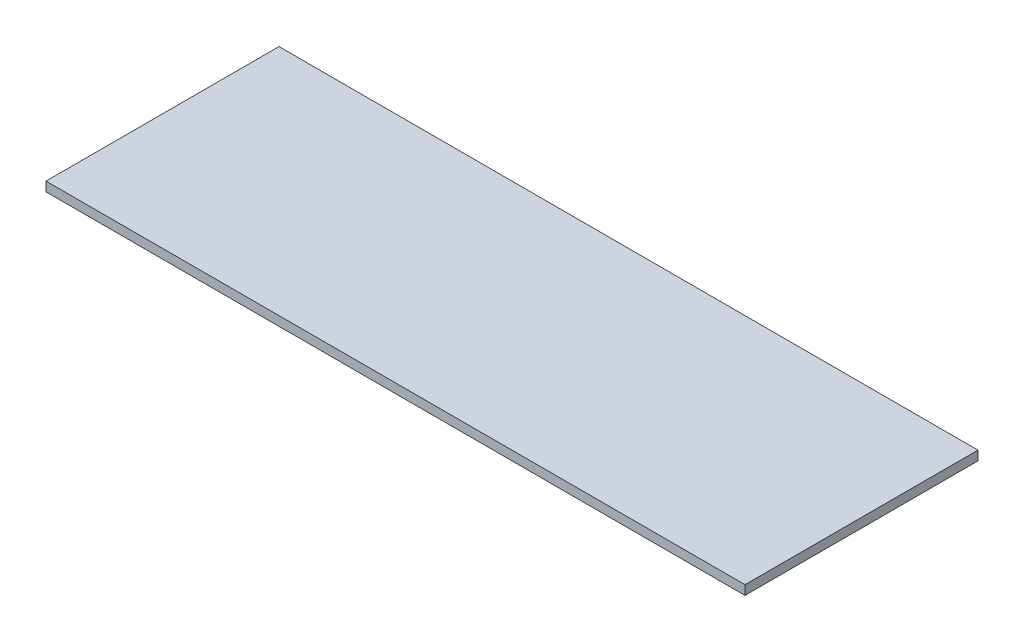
from build123d import *

# Parameters (mm, degrees)
ESQUISSE1_W      = 75
ESQUISSE1_H      = 25
EXTRUSION1_DEPTH = 1


with BuildPart() as part:
    # Esquisse1 → Extrusion1 (new body)
    with BuildSketch(Plane(origin=(0, 0, 0), x_dir=(1, 0, 0), z_dir=(0, 1, 0))):
        with Locations((37.5, 12.5)):
            Rectangle(ESQUISSE1_W, ESQUISSE1_H)
    extrude(amount=EXTRUSION1_DEPTH)


solid = part.part
